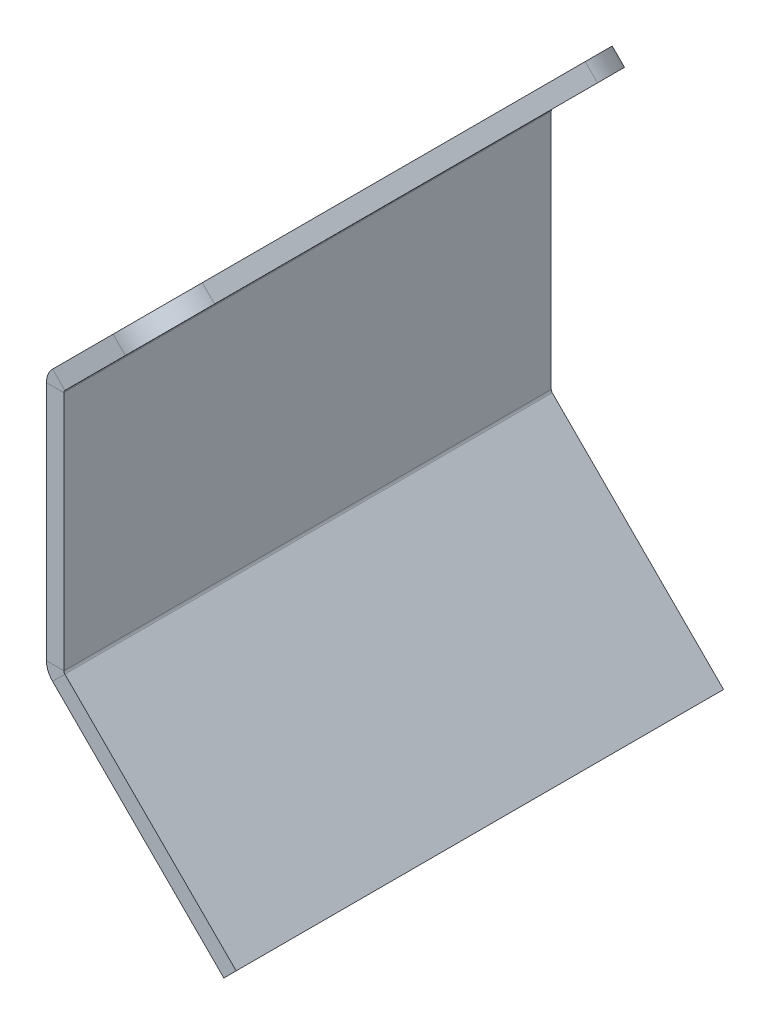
ISO-10303-21;
HEADER;
FILE_DESCRIPTION(('STEP AP214'),'2;1');
FILE_NAME('part.step','',(''),(''),'','','');
FILE_SCHEMA(('AUTOMOTIVE_DESIGN { 1 0 10303 214 1 1 1 1 }'));
ENDSEC;
DATA;
#1=APPLICATION_CONTEXT('core data for automotive mechanical design processes');
#2=APPLICATION_PROTOCOL_DEFINITION('international standard','automotive_design',2000,#1);
#3=PRODUCT_CONTEXT('',#1,'mechanical');
#4=PRODUCT('Part','Part','',(#3));
#5=PRODUCT_RELATED_PRODUCT_CATEGORY('part','',(#4));
#6=PRODUCT_DEFINITION_FORMATION('','',#4);
#7=PRODUCT_DEFINITION_CONTEXT('part definition',#1,'design');
#8=PRODUCT_DEFINITION('design','',#6,#7);
#9=PRODUCT_DEFINITION_SHAPE('','',#8);
#10=(LENGTH_UNIT() NAMED_UNIT(*) SI_UNIT(.MILLI.,.METRE.));
#11=(NAMED_UNIT(*) PLANE_ANGLE_UNIT() SI_UNIT($,.RADIAN.));
#12=(NAMED_UNIT(*) SI_UNIT($,.STERADIAN.) SOLID_ANGLE_UNIT());
#13=UNCERTAINTY_MEASURE_WITH_UNIT(LENGTH_MEASURE(1.E-05),#10,'distance_accuracy_value','');
#14=(GEOMETRIC_REPRESENTATION_CONTEXT(3) GLOBAL_UNCERTAINTY_ASSIGNED_CONTEXT((#13)) GLOBAL_UNIT_ASSIGNED_CONTEXT((#10,
#11,#12)) REPRESENTATION_CONTEXT('',''));
#15=CARTESIAN_POINT('',(0.,0.,0.));
#16=DIRECTION('',(0.,0.,1.));
#17=DIRECTION('',(1.,0.,0.));
#18=AXIS2_PLACEMENT_3D('',#15,#16,#17);
#19=CARTESIAN_POINT('',(270.595560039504,101.600610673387,70.));
#20=DIRECTION('',(-0.707106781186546,0.707106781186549,0.));
#21=DIRECTION('',(-0.707106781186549,-0.707106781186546,0.));
#22=AXIS2_PLACEMENT_3D('',#19,#20,#21);
#23=PLANE('',#22);
#24=DIRECTION('',(-0.707106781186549,-0.707106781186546,0.));
#25=VECTOR('',#24,1.);
#26=CARTESIAN_POINT('',(270.595560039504,101.600610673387,70.));
#27=LINE('',#26,#25);
#28=CARTESIAN_POINT('',(49.4974746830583,-119.497474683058,70.));
#29=VERTEX_POINT('',#28);
#30=CARTESIAN_POINT('',(45.9619407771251,-123.033008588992,70.));
#31=VERTEX_POINT('',#30);
#32=EDGE_CURVE('E174',#29,#31,#27,.T.);
#33=ORIENTED_EDGE('',*,*,#32,.T.);
#34=DIRECTION('',(0.,0.,-1.));
#35=VECTOR('',#34,1.);
#36=CARTESIAN_POINT('',(45.9619407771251,-123.033008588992,70.));
#37=LINE('',#36,#35);
#38=CARTESIAN_POINT('',(45.9619407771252,-123.033008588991,-70.));
#39=VERTEX_POINT('',#38);
#40=EDGE_CURVE('E163',#31,#39,#37,.T.);
#41=ORIENTED_EDGE('',*,*,#40,.T.);
#42=DIRECTION('',(-0.707106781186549,-0.707106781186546,0.));
#43=VECTOR('',#42,1.);
#44=CARTESIAN_POINT('',(270.595560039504,101.600610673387,-70.));
#45=LINE('',#44,#43);
#46=CARTESIAN_POINT('',(49.4974746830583,-119.497474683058,-70.));
#47=VERTEX_POINT('',#46);
#48=EDGE_CURVE('E271',#47,#39,#45,.T.);
#49=ORIENTED_EDGE('',*,*,#48,.F.);
#50=DIRECTION('',(0.,0.,-1.));
#51=VECTOR('',#50,1.);
#52=CARTESIAN_POINT('',(49.4974746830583,-119.497474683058,70.));
#53=LINE('',#52,#51);
#54=EDGE_CURVE('E187',#29,#47,#53,.T.);
#55=ORIENTED_EDGE('',*,*,#54,.F.);
#56=EDGE_LOOP('',(#33,#41,#49,#55));
#57=FACE_BOUND('',#56,.T.);
#58=ADVANCED_FACE('F34',(#57),#23,.F.);
#59=CARTESIAN_POINT('',(221.390978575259,150.805192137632,70.));
#60=DIRECTION('',(0.,0.,-1.));
#61=DIRECTION('',(0.,-1.,0.));
#62=AXIS2_PLACEMENT_3D('',#59,#60,#61);
#63=PLANE('',#62);
#64=DIRECTION('',(-0.707106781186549,-0.707106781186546,0.));
#65=VECTOR('',#64,1.);
#66=CARTESIAN_POINT('',(221.390978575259,150.805192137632,70.));
#67=LINE('',#66,#65);
#68=CARTESIAN_POINT('',(0.292893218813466,-70.2928932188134,70.0000000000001));
#69=VERTEX_POINT('',#68);
#70=CARTESIAN_POINT('',(-3.24264068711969,-73.8284271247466,70.0000000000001));
#71=VERTEX_POINT('',#70);
#72=EDGE_CURVE('E153',#69,#71,#67,.T.);
#73=ORIENTED_EDGE('',*,*,#72,.T.);
#74=DIRECTION('',(0.707106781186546,-0.707106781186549,0.));
#75=VECTOR('',#74,1.);
#76=CARTESIAN_POINT('',(-3.24264068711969,-73.8284271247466,70.));
#77=LINE('',#76,#75);
#78=EDGE_CURVE('E160',#71,#31,#77,.T.);
#79=ORIENTED_EDGE('',*,*,#78,.T.);
#80=ORIENTED_EDGE('',*,*,#32,.F.);
#81=DIRECTION('',(0.707106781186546,-0.707106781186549,0.));
#82=VECTOR('',#81,1.);
#83=CARTESIAN_POINT('',(0.29289321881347,-70.2928932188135,70.));
#84=LINE('',#83,#82);
#85=EDGE_CURVE('E171',#69,#29,#84,.T.);
#86=ORIENTED_EDGE('',*,*,#85,.F.);
#87=EDGE_LOOP('',(#73,#79,#80,#86));
#88=FACE_BOUND('',#87,.T.);
#89=ADVANCED_FACE('F169',(#88),#63,.F.);
#90=CARTESIAN_POINT('',(-3.24264068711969,-73.8284271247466,70.));
#91=DIRECTION('',(0.707106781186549,0.707106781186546,0.));
#92=DIRECTION('',(-0.707106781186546,0.707106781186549,0.));
#93=AXIS2_PLACEMENT_3D('',#90,#91,#92);
#94=PLANE('',#93);
#95=DIRECTION('',(0.707106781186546,-0.707106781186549,0.));
#96=VECTOR('',#95,1.);
#97=CARTESIAN_POINT('',(-3.24264068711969,-73.8284271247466,-70.));
#98=LINE('',#97,#96);
#99=CARTESIAN_POINT('',(-3.2426406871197,-73.8284271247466,-70.));
#100=VERTEX_POINT('',#99);
#101=EDGE_CURVE('E148',#100,#39,#98,.T.);
#102=ORIENTED_EDGE('',*,*,#101,.T.);
#103=ORIENTED_EDGE('',*,*,#40,.F.);
#104=ORIENTED_EDGE('',*,*,#78,.F.);
#105=DIRECTION('',(0.,0.,-1.));
#106=VECTOR('',#105,1.);
#107=CARTESIAN_POINT('',(-3.24264068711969,-73.8284271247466,70.));
#108=LINE('',#107,#106);
#109=EDGE_CURVE('E137',#71,#100,#108,.T.);
#110=ORIENTED_EDGE('',*,*,#109,.T.);
#111=EDGE_LOOP('',(#102,#103,#104,#110));
#112=FACE_BOUND('',#111,.T.);
#113=ADVANCED_FACE('F161',(#112),#94,.F.);
#114=CARTESIAN_POINT('',(221.390978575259,150.805192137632,-70.));
#115=DIRECTION('',(0.,0.,-1.));
#116=DIRECTION('',(0.,-1.,0.));
#117=AXIS2_PLACEMENT_3D('',#114,#115,#116);
#118=PLANE('',#117);
#119=ORIENTED_EDGE('',*,*,#101,.F.);
#120=DIRECTION('',(-0.707106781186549,-0.707106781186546,0.));
#121=VECTOR('',#120,1.);
#122=CARTESIAN_POINT('',(221.390978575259,150.805192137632,-70.));
#123=LINE('',#122,#121);
#124=CARTESIAN_POINT('',(0.292893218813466,-70.2928932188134,-69.9999999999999));
#125=VERTEX_POINT('',#124);
#126=EDGE_CURVE('E179',#125,#100,#123,.T.);
#127=ORIENTED_EDGE('',*,*,#126,.F.);
#128=DIRECTION('',(0.707106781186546,-0.707106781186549,0.));
#129=VECTOR('',#128,1.);
#130=CARTESIAN_POINT('',(0.29289321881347,-70.2928932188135,-70.));
#131=LINE('',#130,#129);
#132=EDGE_CURVE('E147',#125,#47,#131,.T.);
#133=ORIENTED_EDGE('',*,*,#132,.T.);
#134=ORIENTED_EDGE('',*,*,#48,.T.);
#135=EDGE_LOOP('',(#119,#127,#133,#134));
#136=FACE_BOUND('',#135,.T.);
#137=ADVANCED_FACE('F279',(#136),#118,.T.);
#138=CARTESIAN_POINT('',(0.29289321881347,-70.2928932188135,70.));
#139=DIRECTION('',(0.707106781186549,0.707106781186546,0.));
#140=DIRECTION('',(-0.707106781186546,0.707106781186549,0.));
#141=AXIS2_PLACEMENT_3D('',#138,#139,#140);
#142=PLANE('',#141);
#143=ORIENTED_EDGE('',*,*,#132,.F.);
#144=DIRECTION('',(0.,0.,-1.));
#145=VECTOR('',#144,1.);
#146=CARTESIAN_POINT('',(0.29289321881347,-70.2928932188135,70.));
#147=LINE('',#146,#145);
#148=EDGE_CURVE('E181',#69,#125,#147,.T.);
#149=ORIENTED_EDGE('',*,*,#148,.F.);
#150=ORIENTED_EDGE('',*,*,#85,.T.);
#151=ORIENTED_EDGE('',*,*,#54,.T.);
#152=EDGE_LOOP('',(#143,#149,#150,#151));
#153=FACE_BOUND('',#152,.T.);
#154=ADVANCED_FACE('F282',(#153),#142,.T.);
#155=CARTESIAN_POINT('',(-5.00000000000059,-0.414213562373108,70.));
#156=DIRECTION('',(1.,0.,0.));
#157=DIRECTION('',(0.,1.,0.));
#158=AXIS2_PLACEMENT_3D('',#155,#156,#157);
#159=PLANE('',#158);
#160=DIRECTION('',(0.,-1.,0.));
#161=VECTOR('',#160,1.);
#162=CARTESIAN_POINT('',(-5.00000000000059,-0.414213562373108,-70.));
#163=LINE('',#162,#161);
#164=CARTESIAN_POINT('',(-5.00000000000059,-0.414213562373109,-70.));
#165=VERTEX_POINT('',#164);
#166=CARTESIAN_POINT('',(-5.00000000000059,-69.5857864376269,-70.));
#167=VERTEX_POINT('',#166);
#168=EDGE_CURVE('E237',#165,#167,#163,.T.);
#169=ORIENTED_EDGE('',*,*,#168,.T.);
#170=DIRECTION('',(0.,0.,-1.));
#171=VECTOR('',#170,1.);
#172=CARTESIAN_POINT('',(-5.00000000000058,-69.5857864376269,70.));
#173=LINE('',#172,#171);
#174=CARTESIAN_POINT('',(-5.00000000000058,-69.5857864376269,70.0000000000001));
#175=VERTEX_POINT('',#174);
#176=EDGE_CURVE('E240',#175,#167,#173,.T.);
#177=ORIENTED_EDGE('',*,*,#176,.F.);
#178=DIRECTION('',(0.,-1.,0.));
#179=VECTOR('',#178,1.);
#180=CARTESIAN_POINT('',(-5.00000000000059,-0.414213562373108,70.));
#181=LINE('',#180,#179);
#182=CARTESIAN_POINT('',(-5.00000000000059,-0.414213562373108,70.));
#183=VERTEX_POINT('',#182);
#184=EDGE_CURVE('E242',#183,#175,#181,.T.);
#185=ORIENTED_EDGE('',*,*,#184,.F.);
#186=DIRECTION('',(0.,0.,-1.));
#187=VECTOR('',#186,1.);
#188=CARTESIAN_POINT('',(-5.00000000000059,-0.414213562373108,70.));
#189=LINE('',#188,#187);
#190=EDGE_CURVE('E245',#183,#165,#189,.T.);
#191=ORIENTED_EDGE('',*,*,#190,.T.);
#192=EDGE_LOOP('',(#169,#177,#185,#191));
#193=FACE_BOUND('',#192,.T.);
#194=ADVANCED_FACE('F319',(#193),#159,.F.);
#195=CARTESIAN_POINT('',(312.312065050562,-0.414213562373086,-70.));
#196=DIRECTION('',(0.,0.,-1.));
#197=DIRECTION('',(-0.707106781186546,-0.707106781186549,0.));
#198=AXIS2_PLACEMENT_3D('',#195,#196,#197);
#199=PLANE('',#198);
#200=ORIENTED_EDGE('',*,*,#168,.F.);
#201=DIRECTION('',(-1.,0.,0.));
#202=VECTOR('',#201,1.);
#203=CARTESIAN_POINT('',(312.312065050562,-0.414213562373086,-70.));
#204=LINE('',#203,#202);
#205=CARTESIAN_POINT('',(0.,-0.414213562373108,-70.));
#206=VERTEX_POINT('',#205);
#207=EDGE_CURVE('E183',#206,#165,#204,.T.);
#208=ORIENTED_EDGE('',*,*,#207,.F.);
#209=DIRECTION('',(0.,-1.,0.));
#210=VECTOR('',#209,1.);
#211=CARTESIAN_POINT('',(0.,-0.414213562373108,-70.));
#212=LINE('',#211,#210);
#213=CARTESIAN_POINT('',(0.,-69.5857864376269,-69.9999999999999));
#214=VERTEX_POINT('',#213);
#215=EDGE_CURVE('E248',#206,#214,#212,.T.);
#216=ORIENTED_EDGE('',*,*,#215,.T.);
#217=DIRECTION('',(-1.,0.,0.));
#218=VECTOR('',#217,1.);
#219=CARTESIAN_POINT('',(312.312065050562,-69.5857864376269,-70.));
#220=LINE('',#219,#218);
#221=EDGE_CURVE('E259',#214,#167,#220,.T.);
#222=ORIENTED_EDGE('',*,*,#221,.T.);
#223=EDGE_LOOP('',(#200,#208,#216,#222));
#224=FACE_BOUND('',#223,.T.);
#225=ADVANCED_FACE('F340',(#224),#199,.T.);
#226=CARTESIAN_POINT('',(312.312065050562,-0.414213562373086,70.));
#227=DIRECTION('',(0.,0.,-1.));
#228=DIRECTION('',(-0.707106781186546,-0.707106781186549,0.));
#229=AXIS2_PLACEMENT_3D('',#226,#227,#228);
#230=PLANE('',#229);
#231=DIRECTION('',(-1.,0.,0.));
#232=VECTOR('',#231,1.);
#233=CARTESIAN_POINT('',(312.312065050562,-0.414213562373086,70.));
#234=LINE('',#233,#232);
#235=CARTESIAN_POINT('',(0.,-0.414213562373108,70.));
#236=VERTEX_POINT('',#235);
#237=EDGE_CURVE('E263',#236,#183,#234,.T.);
#238=ORIENTED_EDGE('',*,*,#237,.T.);
#239=ORIENTED_EDGE('',*,*,#184,.T.);
#240=DIRECTION('',(-1.,0.,0.));
#241=VECTOR('',#240,1.);
#242=CARTESIAN_POINT('',(312.312065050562,-69.5857864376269,70.));
#243=LINE('',#242,#241);
#244=CARTESIAN_POINT('',(0.,-69.5857864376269,70.0000000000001));
#245=VERTEX_POINT('',#244);
#246=EDGE_CURVE('E156',#245,#175,#243,.T.);
#247=ORIENTED_EDGE('',*,*,#246,.F.);
#248=DIRECTION('',(0.,-1.,0.));
#249=VECTOR('',#248,1.);
#250=CARTESIAN_POINT('',(0.,-0.414213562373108,70.));
#251=LINE('',#250,#249);
#252=EDGE_CURVE('E253',#236,#245,#251,.T.);
#253=ORIENTED_EDGE('',*,*,#252,.F.);
#254=EDGE_LOOP('',(#238,#239,#247,#253));
#255=FACE_BOUND('',#254,.T.);
#256=ADVANCED_FACE('F323',(#255),#230,.F.);
#257=CARTESIAN_POINT('',(0.,-0.414213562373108,70.));
#258=DIRECTION('',(1.,0.,0.));
#259=DIRECTION('',(0.,1.,0.));
#260=AXIS2_PLACEMENT_3D('',#257,#258,#259);
#261=PLANE('',#260);
#262=ORIENTED_EDGE('',*,*,#215,.F.);
#263=DIRECTION('',(0.,0.,-1.));
#264=VECTOR('',#263,1.);
#265=CARTESIAN_POINT('',(0.,-0.414213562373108,70.));
#266=LINE('',#265,#264);
#267=EDGE_CURVE('E251',#236,#206,#266,.T.);
#268=ORIENTED_EDGE('',*,*,#267,.F.);
#269=ORIENTED_EDGE('',*,*,#252,.T.);
#270=DIRECTION('',(0.,0.,-1.));
#271=VECTOR('',#270,1.);
#272=CARTESIAN_POINT('',(0.,-69.5857864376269,70.));
#273=LINE('',#272,#271);
#274=EDGE_CURVE('E256',#245,#214,#273,.T.);
#275=ORIENTED_EDGE('',*,*,#274,.T.);
#276=EDGE_LOOP('',(#262,#268,#269,#275));
#277=FACE_BOUND('',#276,.T.);
#278=ADVANCED_FACE('F359',(#277),#261,.T.);
#279=CARTESIAN_POINT('',(234.03671710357,-177.468174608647,70.));
#280=DIRECTION('',(0.707106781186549,0.707106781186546,0.));
#281=DIRECTION('',(-0.707106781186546,0.707106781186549,0.));
#282=AXIS2_PLACEMENT_3D('',#279,#280,#281);
#283=PLANE('',#282);
#284=DIRECTION('',(0.,0.,-1.));
#285=VECTOR('',#284,1.);
#286=CARTESIAN_POINT('',(28.2842712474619,28.2842712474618,70.));
#287=LINE('',#286,#285);
#288=CARTESIAN_POINT('',(28.2842712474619,28.2842712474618,55.));
#289=VERTEX_POINT('',#288);
#290=CARTESIAN_POINT('',(28.2842712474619,28.2842712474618,-55.));
#291=VERTEX_POINT('',#290);
#292=EDGE_CURVE('E198',#289,#291,#287,.T.);
#293=ORIENTED_EDGE('',*,*,#292,.T.);
#294=DIRECTION('',(-0.707106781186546,0.707106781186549,0.));
#295=VECTOR('',#294,1.);
#296=CARTESIAN_POINT('',(234.03671710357,-177.468174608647,-55.));
#297=LINE('',#296,#295);
#298=CARTESIAN_POINT('',(24.7487373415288,31.819805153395,-55.));
#299=VERTEX_POINT('',#298);
#300=EDGE_CURVE('E186',#291,#299,#297,.T.);
#301=ORIENTED_EDGE('',*,*,#300,.T.);
#302=DIRECTION('',(0.,0.,-1.));
#303=VECTOR('',#302,1.);
#304=CARTESIAN_POINT('',(24.7487373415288,31.819805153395,70.));
#305=LINE('',#304,#303);
#306=CARTESIAN_POINT('',(24.7487373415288,31.819805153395,55.));
#307=VERTEX_POINT('',#306);
#308=EDGE_CURVE('E217',#307,#299,#305,.T.);
#309=ORIENTED_EDGE('',*,*,#308,.F.);
#310=DIRECTION('',(-0.707106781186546,0.707106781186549,0.));
#311=VECTOR('',#310,1.);
#312=CARTESIAN_POINT('',(28.2842712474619,28.2842712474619,55.));
#313=LINE('',#312,#311);
#314=EDGE_CURVE('E184',#307,#289,#313,.F.);
#315=ORIENTED_EDGE('',*,*,#314,.T.);
#316=EDGE_LOOP('',(#293,#301,#309,#315));
#317=FACE_BOUND('',#316,.T.);
#318=ADVANCED_FACE('F204',(#317),#283,.T.);
#319=CARTESIAN_POINT('',(28.2842712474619,28.2842712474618,70.));
#320=DIRECTION('',(0.707106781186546,-0.707106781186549,0.));
#321=DIRECTION('',(0.707106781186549,0.707106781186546,0.));
#322=AXIS2_PLACEMENT_3D('',#319,#320,#321);
#323=PLANE('',#322);
#324=DIRECTION('',(-0.707106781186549,-0.707106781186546,0.));
#325=VECTOR('',#324,1.);
#326=CARTESIAN_POINT('',(28.2842712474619,28.2842712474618,-70.));
#327=LINE('',#326,#325);
#328=CARTESIAN_POINT('',(17.6776695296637,17.6776695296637,-70.));
#329=VERTEX_POINT('',#328);
#330=CARTESIAN_POINT('',(0.292893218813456,0.29289321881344,-70.));
#331=VERTEX_POINT('',#330);
#332=EDGE_CURVE('E200',#329,#331,#327,.T.);
#333=ORIENTED_EDGE('',*,*,#332,.F.);
#334=CARTESIAN_POINT('',(17.6776695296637,17.6776695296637,-55.));
#335=DIRECTION('',(0.707106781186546,-0.707106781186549,0.));
#336=DIRECTION('',(0.707106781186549,0.707106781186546,0.));
#337=AXIS2_PLACEMENT_3D('',#334,#335,#336);
#338=CIRCLE('',#337,15.);
#339=EDGE_CURVE('E42',#329,#291,#338,.T.);
#340=ORIENTED_EDGE('',*,*,#339,.T.);
#341=ORIENTED_EDGE('',*,*,#292,.F.);
#342=CARTESIAN_POINT('',(17.6776695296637,17.6776695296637,55.));
#343=DIRECTION('',(0.707106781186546,-0.707106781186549,0.));
#344=DIRECTION('',(0.707106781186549,0.707106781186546,0.));
#345=AXIS2_PLACEMENT_3D('',#342,#343,#344);
#346=CIRCLE('',#345,15.);
#347=CARTESIAN_POINT('',(17.6776695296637,17.6776695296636,70.));
#348=VERTEX_POINT('',#347);
#349=EDGE_CURVE('E49',#289,#348,#346,.T.);
#350=ORIENTED_EDGE('',*,*,#349,.T.);
#351=DIRECTION('',(-0.707106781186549,-0.707106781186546,0.));
#352=VECTOR('',#351,1.);
#353=CARTESIAN_POINT('',(28.2842712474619,28.2842712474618,70.));
#354=LINE('',#353,#352);
#355=CARTESIAN_POINT('',(0.292893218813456,0.29289321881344,70.));
#356=VERTEX_POINT('',#355);
#357=EDGE_CURVE('E208',#348,#356,#354,.T.);
#358=ORIENTED_EDGE('',*,*,#357,.T.);
#359=DIRECTION('',(0.,0.,-1.));
#360=VECTOR('',#359,1.);
#361=CARTESIAN_POINT('',(0.292893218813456,0.29289321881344,70.));
#362=LINE('',#361,#360);
#363=EDGE_CURVE('E229',#356,#331,#362,.T.);
#364=ORIENTED_EDGE('',*,*,#363,.T.);
#365=EDGE_LOOP('',(#333,#340,#341,#350,#358,#364));
#366=FACE_BOUND('',#365,.T.);
#367=ADVANCED_FACE('F197',(#366),#323,.T.);
#368=CARTESIAN_POINT('',(234.03671710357,-177.468174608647,-70.));
#369=DIRECTION('',(0.,0.,-1.));
#370=DIRECTION('',(-1.,0.,0.));
#371=AXIS2_PLACEMENT_3D('',#368,#369,#370);
#372=PLANE('',#371);
#373=DIRECTION('',(-0.707106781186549,-0.707106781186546,0.));
#374=VECTOR('',#373,1.);
#375=CARTESIAN_POINT('',(24.7487373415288,31.819805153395,-70.));
#376=LINE('',#375,#374);
#377=CARTESIAN_POINT('',(14.1421356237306,21.2132034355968,-70.));
#378=VERTEX_POINT('',#377);
#379=CARTESIAN_POINT('',(-3.2426406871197,3.8284271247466,-70.));
#380=VERTEX_POINT('',#379);
#381=EDGE_CURVE('E215',#378,#380,#376,.T.);
#382=ORIENTED_EDGE('',*,*,#381,.F.);
#383=DIRECTION('',(-0.707106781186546,0.707106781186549,0.));
#384=VECTOR('',#383,1.);
#385=CARTESIAN_POINT('',(223.430115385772,-188.074776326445,-70.));
#386=LINE('',#385,#384);
#387=EDGE_CURVE('E57',#378,#329,#386,.F.);
#388=ORIENTED_EDGE('',*,*,#387,.T.);
#389=ORIENTED_EDGE('',*,*,#332,.T.);
#390=DIRECTION('',(-0.707106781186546,0.707106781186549,0.));
#391=VECTOR('',#390,1.);
#392=CARTESIAN_POINT('',(206.045339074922,-205.459552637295,-70.));
#393=LINE('',#392,#391);
#394=EDGE_CURVE('E221',#331,#380,#393,.T.);
#395=ORIENTED_EDGE('',*,*,#394,.T.);
#396=EDGE_LOOP('',(#382,#388,#389,#395));
#397=FACE_BOUND('',#396,.T.);
#398=ADVANCED_FACE('F219',(#397),#372,.T.);
#399=CARTESIAN_POINT('',(24.7487373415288,31.819805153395,70.));
#400=DIRECTION('',(0.707106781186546,-0.707106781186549,0.));
#401=DIRECTION('',(0.707106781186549,0.707106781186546,0.));
#402=AXIS2_PLACEMENT_3D('',#399,#400,#401);
#403=PLANE('',#402);
#404=ORIENTED_EDGE('',*,*,#308,.T.);
#405=CARTESIAN_POINT('',(14.1421356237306,21.2132034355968,-55.));
#406=DIRECTION('',(0.707106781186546,-0.707106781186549,0.));
#407=DIRECTION('',(0.707106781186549,0.707106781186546,0.));
#408=AXIS2_PLACEMENT_3D('',#405,#406,#407);
#409=CIRCLE('',#408,15.);
#410=EDGE_CURVE('E192',#299,#378,#409,.F.);
#411=ORIENTED_EDGE('',*,*,#410,.T.);
#412=ORIENTED_EDGE('',*,*,#381,.T.);
#413=DIRECTION('',(0.,0.,-1.));
#414=VECTOR('',#413,1.);
#415=CARTESIAN_POINT('',(-3.2426406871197,3.8284271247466,70.));
#416=LINE('',#415,#414);
#417=CARTESIAN_POINT('',(-3.2426406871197,3.8284271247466,70.));
#418=VERTEX_POINT('',#417);
#419=EDGE_CURVE('E209',#418,#380,#416,.T.);
#420=ORIENTED_EDGE('',*,*,#419,.F.);
#421=DIRECTION('',(-0.707106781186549,-0.707106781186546,0.));
#422=VECTOR('',#421,1.);
#423=CARTESIAN_POINT('',(24.7487373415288,31.819805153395,70.));
#424=LINE('',#423,#422);
#425=CARTESIAN_POINT('',(14.1421356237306,21.2132034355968,70.));
#426=VERTEX_POINT('',#425);
#427=EDGE_CURVE('E223',#426,#418,#424,.T.);
#428=ORIENTED_EDGE('',*,*,#427,.F.);
#429=CARTESIAN_POINT('',(14.1421356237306,21.2132034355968,55.));
#430=DIRECTION('',(0.707106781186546,-0.707106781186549,0.));
#431=DIRECTION('',(0.707106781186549,0.707106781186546,0.));
#432=AXIS2_PLACEMENT_3D('',#429,#430,#431);
#433=CIRCLE('',#432,15.);
#434=EDGE_CURVE('E190',#426,#307,#433,.F.);
#435=ORIENTED_EDGE('',*,*,#434,.T.);
#436=EDGE_LOOP('',(#404,#411,#412,#420,#428,#435));
#437=FACE_BOUND('',#436,.T.);
#438=ADVANCED_FACE('F213',(#437),#403,.F.);
#439=CARTESIAN_POINT('',(234.03671710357,-177.468174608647,70.));
#440=DIRECTION('',(0.,0.,-1.));
#441=DIRECTION('',(-1.,0.,0.));
#442=AXIS2_PLACEMENT_3D('',#439,#440,#441);
#443=PLANE('',#442);
#444=ORIENTED_EDGE('',*,*,#357,.F.);
#445=DIRECTION('',(-0.707106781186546,0.707106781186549,0.));
#446=VECTOR('',#445,1.);
#447=CARTESIAN_POINT('',(14.1421356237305,21.2132034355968,70.));
#448=LINE('',#447,#446);
#449=EDGE_CURVE('E11',#348,#426,#448,.T.);
#450=ORIENTED_EDGE('',*,*,#449,.T.);
#451=ORIENTED_EDGE('',*,*,#427,.T.);
#452=DIRECTION('',(-0.707106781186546,0.707106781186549,0.));
#453=VECTOR('',#452,1.);
#454=CARTESIAN_POINT('',(206.045339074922,-205.459552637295,70.));
#455=LINE('',#454,#453);
#456=EDGE_CURVE('E233',#356,#418,#455,.T.);
#457=ORIENTED_EDGE('',*,*,#456,.F.);
#458=EDGE_LOOP('',(#444,#450,#451,#457));
#459=FACE_BOUND('',#458,.T.);
#460=ADVANCED_FACE('F307',(#459),#443,.F.);
#461=CARTESIAN_POINT('',(1.,-0.414213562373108,-70.));
#462=DIRECTION('',(0.,0.,-1.));
#463=DIRECTION('',(-1.,0.,0.));
#464=AXIS2_PLACEMENT_3D('',#461,#462,#463);
#465=PLANE('',#464);
#466=ORIENTED_EDGE('',*,*,#394,.F.);
#467=CARTESIAN_POINT('',(1.,-0.414213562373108,-70.));
#468=DIRECTION('',(0.,0.,-1.));
#469=DIRECTION('',(-1.,0.,0.));
#470=AXIS2_PLACEMENT_3D('',#467,#468,#469);
#471=CIRCLE('',#470,0.999999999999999);
#472=EDGE_CURVE('E298',#331,#206,#471,.F.);
#473=ORIENTED_EDGE('',*,*,#472,.T.);
#474=ORIENTED_EDGE('',*,*,#207,.T.);
#475=CARTESIAN_POINT('',(1.,-0.414213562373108,-70.));
#476=DIRECTION('',(0.,0.,-1.));
#477=DIRECTION('',(-1.,0.,0.));
#478=AXIS2_PLACEMENT_3D('',#475,#476,#477);
#479=CIRCLE('',#478,6.00000000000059);
#480=EDGE_CURVE('E236',#380,#165,#479,.F.);
#481=ORIENTED_EDGE('',*,*,#480,.F.);
#482=EDGE_LOOP('',(#466,#473,#474,#481));
#483=FACE_BOUND('',#482,.T.);
#484=ADVANCED_FACE('F402',(#483),#465,.T.);
#485=CARTESIAN_POINT('',(1.,-0.414213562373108,70.));
#486=DIRECTION('',(0.,0.,1.));
#487=DIRECTION('',(1.,0.,0.));
#488=AXIS2_PLACEMENT_3D('',#485,#486,#487);
#489=PLANE('',#488);
#490=ORIENTED_EDGE('',*,*,#237,.F.);
#491=CARTESIAN_POINT('',(1.,-0.414213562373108,70.));
#492=DIRECTION('',(0.,0.,-1.));
#493=DIRECTION('',(-1.,0.,0.));
#494=AXIS2_PLACEMENT_3D('',#491,#492,#493);
#495=CIRCLE('',#494,0.999999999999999);
#496=EDGE_CURVE('E300',#236,#356,#495,.T.);
#497=ORIENTED_EDGE('',*,*,#496,.T.);
#498=ORIENTED_EDGE('',*,*,#456,.T.);
#499=CARTESIAN_POINT('',(1.,-0.414213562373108,70.));
#500=DIRECTION('',(0.,0.,-1.));
#501=DIRECTION('',(-1.,0.,0.));
#502=AXIS2_PLACEMENT_3D('',#499,#500,#501);
#503=CIRCLE('',#502,6.00000000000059);
#504=EDGE_CURVE('E295',#183,#418,#503,.T.);
#505=ORIENTED_EDGE('',*,*,#504,.F.);
#506=EDGE_LOOP('',(#490,#497,#498,#505));
#507=FACE_BOUND('',#506,.T.);
#508=ADVANCED_FACE('F311',(#507),#489,.T.);
#509=CARTESIAN_POINT('',(1.,-0.414213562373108,305.076366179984));
#510=DIRECTION('',(0.,0.,-1.));
#511=DIRECTION('',(-1.,0.,0.));
#512=AXIS2_PLACEMENT_3D('',#509,#510,#511);
#513=CYLINDRICAL_SURFACE('',#512,6.00000000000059);
#514=ORIENTED_EDGE('',*,*,#504,.T.);
#515=ORIENTED_EDGE('',*,*,#419,.T.);
#516=ORIENTED_EDGE('',*,*,#480,.T.);
#517=ORIENTED_EDGE('',*,*,#190,.F.);
#518=EDGE_LOOP('',(#514,#515,#516,#517));
#519=FACE_BOUND('',#518,.T.);
#520=ADVANCED_FACE('F316',(#519),#513,.T.);
#521=CARTESIAN_POINT('',(1.,-0.414213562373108,305.076366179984));
#522=DIRECTION('',(0.,0.,-1.));
#523=DIRECTION('',(-1.,0.,0.));
#524=AXIS2_PLACEMENT_3D('',#521,#522,#523);
#525=CYLINDRICAL_SURFACE('',#524,0.999999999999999);
#526=ORIENTED_EDGE('',*,*,#496,.F.);
#527=ORIENTED_EDGE('',*,*,#267,.T.);
#528=ORIENTED_EDGE('',*,*,#472,.F.);
#529=ORIENTED_EDGE('',*,*,#363,.F.);
#530=EDGE_LOOP('',(#526,#527,#528,#529));
#531=FACE_BOUND('',#530,.T.);
#532=ADVANCED_FACE('F326',(#531),#525,.F.);
#533=CARTESIAN_POINT('',(1.00000000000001,-69.5857864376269,-70.));
#534=DIRECTION('',(0.,0.,-1.));
#535=DIRECTION('',(-1.,0.,0.));
#536=AXIS2_PLACEMENT_3D('',#533,#534,#535);
#537=PLANE('',#536);
#538=ORIENTED_EDGE('',*,*,#221,.F.);
#539=CARTESIAN_POINT('',(1.00000000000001,-69.5857864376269,-69.9999999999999));
#540=DIRECTION('',(0.,0.,-1.));
#541=DIRECTION('',(-1.,0.,0.));
#542=AXIS2_PLACEMENT_3D('',#539,#540,#541);
#543=CIRCLE('',#542,0.999999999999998);
#544=EDGE_CURVE('E157',#214,#125,#543,.F.);
#545=ORIENTED_EDGE('',*,*,#544,.T.);
#546=ORIENTED_EDGE('',*,*,#126,.T.);
#547=CARTESIAN_POINT('',(1.00000000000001,-69.5857864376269,-69.9999999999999));
#548=DIRECTION('',(0.,0.,-1.));
#549=DIRECTION('',(-1.,0.,0.));
#550=AXIS2_PLACEMENT_3D('',#547,#548,#549);
#551=CIRCLE('',#550,6.00000000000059);
#552=EDGE_CURVE('E143',#167,#100,#551,.F.);
#553=ORIENTED_EDGE('',*,*,#552,.F.);
#554=EDGE_LOOP('',(#538,#545,#546,#553));
#555=FACE_BOUND('',#554,.T.);
#556=ADVANCED_FACE('F290',(#555),#537,.T.);
#557=CARTESIAN_POINT('',(1.00000000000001,-69.5857864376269,70.));
#558=DIRECTION('',(0.,0.,1.));
#559=DIRECTION('',(1.,0.,0.));
#560=AXIS2_PLACEMENT_3D('',#557,#558,#559);
#561=PLANE('',#560);
#562=ORIENTED_EDGE('',*,*,#72,.F.);
#563=CARTESIAN_POINT('',(1.00000000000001,-69.5857864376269,70.0000000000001));
#564=DIRECTION('',(0.,0.,-1.));
#565=DIRECTION('',(-1.,0.,0.));
#566=AXIS2_PLACEMENT_3D('',#563,#564,#565);
#567=CIRCLE('',#566,0.999999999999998);
#568=EDGE_CURVE('E288',#69,#245,#567,.T.);
#569=ORIENTED_EDGE('',*,*,#568,.T.);
#570=ORIENTED_EDGE('',*,*,#246,.T.);
#571=CARTESIAN_POINT('',(1.00000000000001,-69.5857864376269,70.0000000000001));
#572=DIRECTION('',(0.,0.,-1.));
#573=DIRECTION('',(-1.,0.,0.));
#574=AXIS2_PLACEMENT_3D('',#571,#572,#573);
#575=CIRCLE('',#574,6.00000000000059);
#576=EDGE_CURVE('E140',#71,#175,#575,.T.);
#577=ORIENTED_EDGE('',*,*,#576,.F.);
#578=EDGE_LOOP('',(#562,#569,#570,#577));
#579=FACE_BOUND('',#578,.T.);
#580=ADVANCED_FACE('F151',(#579),#561,.T.);
#581=CARTESIAN_POINT('',(1.00000000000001,-69.5857864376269,295.59593233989));
#582=DIRECTION('',(0.,0.,-1.));
#583=DIRECTION('',(-1.,0.,0.));
#584=AXIS2_PLACEMENT_3D('',#581,#582,#583);
#585=CYLINDRICAL_SURFACE('',#584,6.00000000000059);
#586=ORIENTED_EDGE('',*,*,#576,.T.);
#587=ORIENTED_EDGE('',*,*,#176,.T.);
#588=ORIENTED_EDGE('',*,*,#552,.T.);
#589=ORIENTED_EDGE('',*,*,#109,.F.);
#590=EDGE_LOOP('',(#586,#587,#588,#589));
#591=FACE_BOUND('',#590,.T.);
#592=ADVANCED_FACE('F139',(#591),#585,.T.);
#593=CARTESIAN_POINT('',(1.00000000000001,-69.5857864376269,295.59593233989));
#594=DIRECTION('',(0.,0.,-1.));
#595=DIRECTION('',(-1.,0.,0.));
#596=AXIS2_PLACEMENT_3D('',#593,#594,#595);
#597=CYLINDRICAL_SURFACE('',#596,0.999999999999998);
#598=ORIENTED_EDGE('',*,*,#568,.F.);
#599=ORIENTED_EDGE('',*,*,#148,.T.);
#600=ORIENTED_EDGE('',*,*,#544,.F.);
#601=ORIENTED_EDGE('',*,*,#274,.F.);
#602=EDGE_LOOP('',(#598,#599,#600,#601));
#603=FACE_BOUND('',#602,.T.);
#604=ADVANCED_FACE('F286',(#603),#597,.F.);
#605=CARTESIAN_POINT('',(223.430115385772,-188.074776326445,-55.));
#606=DIRECTION('',(-0.707106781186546,0.707106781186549,0.));
#607=DIRECTION('',(-0.707106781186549,-0.707106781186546,0.));
#608=AXIS2_PLACEMENT_3D('',#605,#606,#607);
#609=CYLINDRICAL_SURFACE('',#608,15.);
#610=ORIENTED_EDGE('',*,*,#339,.F.);
#611=ORIENTED_EDGE('',*,*,#387,.F.);
#612=ORIENTED_EDGE('',*,*,#410,.F.);
#613=ORIENTED_EDGE('',*,*,#300,.F.);
#614=EDGE_LOOP('',(#610,#611,#612,#613));
#615=FACE_BOUND('',#614,.T.);
#616=ADVANCED_FACE('F211',(#615),#609,.T.);
#617=CARTESIAN_POINT('',(223.430115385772,-188.074776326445,55.));
#618=DIRECTION('',(0.707106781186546,-0.707106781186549,0.));
#619=DIRECTION('',(0.707106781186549,0.707106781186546,0.));
#620=AXIS2_PLACEMENT_3D('',#617,#618,#619);
#621=CYLINDRICAL_SURFACE('',#620,15.);
#622=ORIENTED_EDGE('',*,*,#349,.F.);
#623=ORIENTED_EDGE('',*,*,#314,.F.);
#624=ORIENTED_EDGE('',*,*,#434,.F.);
#625=ORIENTED_EDGE('',*,*,#449,.F.);
#626=EDGE_LOOP('',(#622,#623,#624,#625));
#627=FACE_BOUND('',#626,.T.);
#628=ADVANCED_FACE('F36',(#627),#621,.T.);
#629=CLOSED_SHELL('',(#58,#89,#113,#137,#154,#194,#225,#256,#278,#318,#367,#398,#438,#460,#484,
#508,#520,#532,#556,#580,#592,#604,#616,#628));
#630=MANIFOLD_SOLID_BREP('B2',#629);
#631=ADVANCED_BREP_SHAPE_REPRESENTATION('',(#18,#630),#14);
#632=SHAPE_DEFINITION_REPRESENTATION(#9,#631);
ENDSEC;
END-ISO-10303-21;
